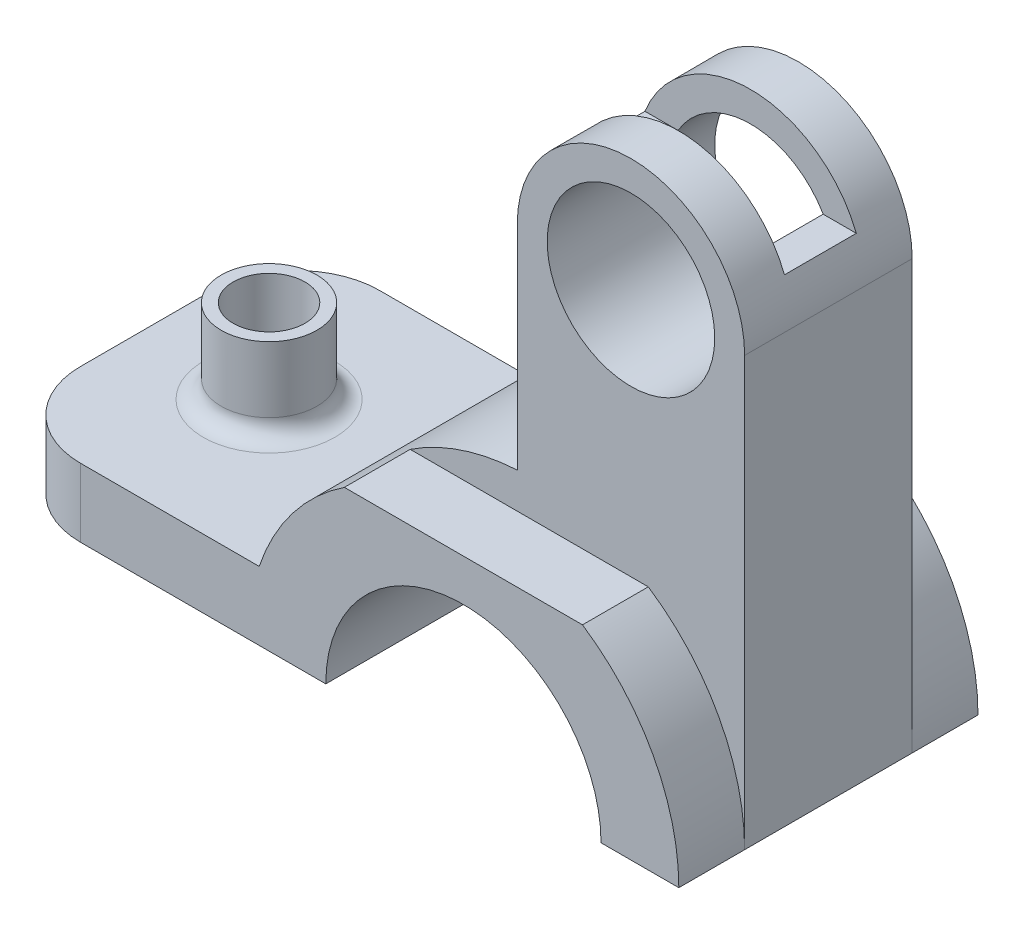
ISO-10303-21;
HEADER;
FILE_DESCRIPTION(('STEP AP214'),'2;1');
FILE_NAME('part.step','',(''),(''),'','','');
FILE_SCHEMA(('AUTOMOTIVE_DESIGN { 1 0 10303 214 1 1 1 1 }'));
ENDSEC;
DATA;
#1=APPLICATION_CONTEXT('core data for automotive mechanical design processes');
#2=APPLICATION_PROTOCOL_DEFINITION('international standard','automotive_design',2000,#1);
#3=PRODUCT_CONTEXT('',#1,'mechanical');
#4=PRODUCT('Part','Part','',(#3));
#5=PRODUCT_RELATED_PRODUCT_CATEGORY('part','',(#4));
#6=PRODUCT_DEFINITION_FORMATION('','',#4);
#7=PRODUCT_DEFINITION_CONTEXT('part definition',#1,'design');
#8=PRODUCT_DEFINITION('design','',#6,#7);
#9=PRODUCT_DEFINITION_SHAPE('','',#8);
#10=(LENGTH_UNIT() NAMED_UNIT(*) SI_UNIT(.MILLI.,.METRE.));
#11=(NAMED_UNIT(*) PLANE_ANGLE_UNIT() SI_UNIT($,.RADIAN.));
#12=(NAMED_UNIT(*) SI_UNIT($,.STERADIAN.) SOLID_ANGLE_UNIT());
#13=UNCERTAINTY_MEASURE_WITH_UNIT(LENGTH_MEASURE(1.E-05),#10,'distance_accuracy_value','');
#14=(GEOMETRIC_REPRESENTATION_CONTEXT(3) GLOBAL_UNCERTAINTY_ASSIGNED_CONTEXT((#13)) GLOBAL_UNIT_ASSIGNED_CONTEXT((#10,
#11,#12)) REPRESENTATION_CONTEXT('',''));
#15=CARTESIAN_POINT('',(0.,0.,0.));
#16=DIRECTION('',(0.,0.,1.));
#17=DIRECTION('',(1.,0.,0.));
#18=AXIS2_PLACEMENT_3D('',#15,#16,#17);
#19=CARTESIAN_POINT('',(0.,0.,25.));
#20=DIRECTION('',(0.,0.,-1.));
#21=DIRECTION('',(-1.,0.,0.));
#22=AXIS2_PLACEMENT_3D('',#19,#20,#21);
#23=CYLINDRICAL_SURFACE('',#22,36.);
#24=CARTESIAN_POINT('',(0.,0.,-25.));
#25=DIRECTION('',(0.,0.,1.));
#26=DIRECTION('',(1.,0.,0.));
#27=AXIS2_PLACEMENT_3D('',#24,#25,#26);
#28=CIRCLE('',#27,36.);
#29=CARTESIAN_POINT('',(36.,0.,-25.));
#30=VERTEX_POINT('',#29);
#31=CARTESIAN_POINT('',(19.8997487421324,30.,-25.));
#32=VERTEX_POINT('',#31);
#33=EDGE_CURVE('E274',#30,#32,#28,.T.);
#34=ORIENTED_EDGE('',*,*,#33,.T.);
#35=DIRECTION('',(0.,0.,-1.));
#36=VECTOR('',#35,1.);
#37=CARTESIAN_POINT('',(19.8997487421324,30.,25.));
#38=LINE('',#37,#36);
#39=CARTESIAN_POINT('',(19.8997487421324,30.,-14.));
#40=VERTEX_POINT('',#39);
#41=EDGE_CURVE('E378',#32,#40,#38,.F.);
#42=ORIENTED_EDGE('',*,*,#41,.T.);
#43=CARTESIAN_POINT('',(0.,0.,-14.));
#44=DIRECTION('',(0.,0.,1.));
#45=DIRECTION('',(1.,0.,0.));
#46=AXIS2_PLACEMENT_3D('',#43,#44,#45);
#47=CIRCLE('',#46,36.);
#48=CARTESIAN_POINT('',(36.,0.,-14.));
#49=VERTEX_POINT('',#48);
#50=EDGE_CURVE('E328',#40,#49,#47,.F.);
#51=ORIENTED_EDGE('',*,*,#50,.T.);
#52=DIRECTION('',(0.,0.,-1.));
#53=VECTOR('',#52,1.);
#54=CARTESIAN_POINT('',(36.,0.,25.));
#55=LINE('',#54,#53);
#56=EDGE_CURVE('E248',#49,#30,#55,.T.);
#57=ORIENTED_EDGE('',*,*,#56,.T.);
#58=EDGE_LOOP('',(#34,#42,#51,#57));
#59=FACE_BOUND('',#58,.T.);
#60=ADVANCED_FACE('F42',(#59),#23,.T.);
#61=CARTESIAN_POINT('',(0.,0.,14.));
#62=DIRECTION('',(0.,0.,1.));
#63=DIRECTION('',(1.,0.,0.));
#64=AXIS2_PLACEMENT_3D('',#61,#62,#63);
#65=CIRCLE('',#64,36.);
#66=CARTESIAN_POINT('',(19.8997487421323,30.,14.));
#67=VERTEX_POINT('',#66);
#68=CARTESIAN_POINT('',(36.,0.,14.));
#69=VERTEX_POINT('',#68);
#70=EDGE_CURVE('E344',#67,#69,#65,.F.);
#71=ORIENTED_EDGE('',*,*,#70,.F.);
#72=DIRECTION('',(0.,0.,-1.));
#73=VECTOR('',#72,1.);
#74=CARTESIAN_POINT('',(19.8997487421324,30.,25.));
#75=LINE('',#74,#73);
#76=CARTESIAN_POINT('',(19.8997487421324,30.,25.));
#77=VERTEX_POINT('',#76);
#78=EDGE_CURVE('E359',#67,#77,#75,.F.);
#79=ORIENTED_EDGE('',*,*,#78,.T.);
#80=CARTESIAN_POINT('',(0.,0.,25.));
#81=DIRECTION('',(0.,0.,1.));
#82=DIRECTION('',(1.,0.,0.));
#83=AXIS2_PLACEMENT_3D('',#80,#81,#82);
#84=CIRCLE('',#83,36.);
#85=CARTESIAN_POINT('',(36.,0.,25.));
#86=VERTEX_POINT('',#85);
#87=EDGE_CURVE('E294',#86,#77,#84,.T.);
#88=ORIENTED_EDGE('',*,*,#87,.F.);
#89=EDGE_CURVE('E244',#86,#69,#55,.T.);
#90=ORIENTED_EDGE('',*,*,#89,.T.);
#91=EDGE_LOOP('',(#71,#79,#88,#90));
#92=FACE_BOUND('',#91,.T.);
#93=ADVANCED_FACE('F433',(#92),#23,.T.);
#94=CARTESIAN_POINT('',(0.,0.,25.));
#95=DIRECTION('',(0.,0.,-1.));
#96=DIRECTION('',(-1.,0.,0.));
#97=AXIS2_PLACEMENT_3D('',#94,#95,#96);
#98=CYLINDRICAL_SURFACE('',#97,23.);
#99=CARTESIAN_POINT('',(0.,0.,-25.));
#100=DIRECTION('',(0.,0.,-1.));
#101=DIRECTION('',(1.,0.,0.));
#102=AXIS2_PLACEMENT_3D('',#99,#100,#101);
#103=CIRCLE('',#102,23.);
#104=CARTESIAN_POINT('',(-23.,0.,-25.));
#105=VERTEX_POINT('',#104);
#106=CARTESIAN_POINT('',(23.,0.,-25.));
#107=VERTEX_POINT('',#106);
#108=EDGE_CURVE('E283',#105,#107,#103,.T.);
#109=ORIENTED_EDGE('',*,*,#108,.T.);
#110=DIRECTION('',(0.,0.,-1.));
#111=VECTOR('',#110,1.);
#112=CARTESIAN_POINT('',(23.,0.,25.));
#113=LINE('',#112,#111);
#114=CARTESIAN_POINT('',(23.,0.,25.));
#115=VERTEX_POINT('',#114);
#116=EDGE_CURVE('E240',#115,#107,#113,.T.);
#117=ORIENTED_EDGE('',*,*,#116,.F.);
#118=CARTESIAN_POINT('',(0.,0.,25.));
#119=DIRECTION('',(0.,0.,-1.));
#120=DIRECTION('',(1.,0.,0.));
#121=AXIS2_PLACEMENT_3D('',#118,#119,#120);
#122=CIRCLE('',#121,23.);
#123=CARTESIAN_POINT('',(-23.,0.,25.));
#124=VERTEX_POINT('',#123);
#125=EDGE_CURVE('E269',#124,#115,#122,.T.);
#126=ORIENTED_EDGE('',*,*,#125,.F.);
#127=DIRECTION('',(0.,0.,-1.));
#128=VECTOR('',#127,1.);
#129=CARTESIAN_POINT('',(-23.,0.,25.));
#130=LINE('',#129,#128);
#131=EDGE_CURVE('E261',#124,#105,#130,.T.);
#132=ORIENTED_EDGE('',*,*,#131,.T.);
#133=EDGE_LOOP('',(#109,#117,#126,#132));
#134=FACE_BOUND('',#133,.T.);
#135=ADVANCED_FACE('F440',(#134),#98,.F.);
#136=CARTESIAN_POINT('',(23.,0.,25.));
#137=DIRECTION('',(0.,1.,0.));
#138=DIRECTION('',(0.,0.,1.));
#139=AXIS2_PLACEMENT_3D('',#136,#137,#138);
#140=PLANE('',#139);
#141=DIRECTION('',(1.,0.,0.));
#142=VECTOR('',#141,1.);
#143=CARTESIAN_POINT('',(23.,0.,-25.));
#144=LINE('',#143,#142);
#145=EDGE_CURVE('E279',#107,#30,#144,.T.);
#146=ORIENTED_EDGE('',*,*,#145,.T.);
#147=ORIENTED_EDGE('',*,*,#56,.F.);
#148=DIRECTION('',(0.,0.,-1.));
#149=VECTOR('',#148,1.);
#150=CARTESIAN_POINT('',(36.,0.,14.));
#151=LINE('',#150,#149);
#152=EDGE_CURVE('E308',#69,#49,#151,.T.);
#153=ORIENTED_EDGE('',*,*,#152,.F.);
#154=ORIENTED_EDGE('',*,*,#89,.F.);
#155=DIRECTION('',(1.,0.,0.));
#156=VECTOR('',#155,1.);
#157=CARTESIAN_POINT('',(23.,0.,25.));
#158=LINE('',#157,#156);
#159=EDGE_CURVE('E299',#115,#86,#158,.T.);
#160=ORIENTED_EDGE('',*,*,#159,.F.);
#161=ORIENTED_EDGE('',*,*,#116,.T.);
#162=EDGE_LOOP('',(#146,#147,#153,#154,#160,#161));
#163=FACE_BOUND('',#162,.T.);
#164=ADVANCED_FACE('F446',(#163),#140,.F.);
#165=CARTESIAN_POINT('',(0.,0.,-14.));
#166=DIRECTION('',(0.,0.,-1.));
#167=DIRECTION('',(-1.,0.,0.));
#168=AXIS2_PLACEMENT_3D('',#165,#166,#167);
#169=CIRCLE('',#168,36.);
#170=CARTESIAN_POINT('',(-19.8997487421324,30.,-14.));
#171=VERTEX_POINT('',#170);
#172=CARTESIAN_POINT('',(-2.,35.9444015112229,-14.));
#173=VERTEX_POINT('',#172);
#174=EDGE_CURVE('E367',#171,#173,#169,.T.);
#175=ORIENTED_EDGE('',*,*,#174,.F.);
#176=DIRECTION('',(0.,0.,-1.));
#177=VECTOR('',#176,1.);
#178=CARTESIAN_POINT('',(-19.8997487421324,30.,25.));
#179=LINE('',#178,#177);
#180=CARTESIAN_POINT('',(-19.8997487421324,30.,-25.));
#181=VERTEX_POINT('',#180);
#182=EDGE_CURVE('E374',#171,#181,#179,.T.);
#183=ORIENTED_EDGE('',*,*,#182,.T.);
#184=CARTESIAN_POINT('',(-34.1335418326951,11.4412115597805,-25.));
#185=VERTEX_POINT('',#184);
#186=EDGE_CURVE('E278',#181,#185,#28,.T.);
#187=ORIENTED_EDGE('',*,*,#186,.T.);
#188=DIRECTION('',(0.,0.,-1.));
#189=VECTOR('',#188,1.);
#190=CARTESIAN_POINT('',(-34.1335418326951,11.4412115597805,25.));
#191=LINE('',#190,#189);
#192=CARTESIAN_POINT('',(-34.1335418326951,11.4412115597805,25.));
#193=VERTEX_POINT('',#192);
#194=EDGE_CURVE('E249',#193,#185,#191,.T.);
#195=ORIENTED_EDGE('',*,*,#194,.F.);
#196=CARTESIAN_POINT('',(-19.8997487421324,30.,25.));
#197=VERTEX_POINT('',#196);
#198=EDGE_CURVE('E298',#197,#193,#84,.T.);
#199=ORIENTED_EDGE('',*,*,#198,.F.);
#200=DIRECTION('',(0.,0.,-1.));
#201=VECTOR('',#200,1.);
#202=CARTESIAN_POINT('',(-19.8997487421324,30.,25.));
#203=LINE('',#202,#201);
#204=CARTESIAN_POINT('',(-19.8997487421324,30.,14.));
#205=VERTEX_POINT('',#204);
#206=EDGE_CURVE('E355',#197,#205,#203,.T.);
#207=ORIENTED_EDGE('',*,*,#206,.T.);
#208=CARTESIAN_POINT('',(0.,0.,14.));
#209=DIRECTION('',(0.,0.,1.));
#210=DIRECTION('',(1.,0.,0.));
#211=AXIS2_PLACEMENT_3D('',#208,#209,#210);
#212=CIRCLE('',#211,36.);
#213=CARTESIAN_POINT('',(-2.,35.9444015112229,14.));
#214=VERTEX_POINT('',#213);
#215=EDGE_CURVE('E338',#214,#205,#212,.T.);
#216=ORIENTED_EDGE('',*,*,#215,.F.);
#217=DIRECTION('',(0.,0.,-1.));
#218=VECTOR('',#217,1.);
#219=CARTESIAN_POINT('',(-2.,35.9444015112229,14.));
#220=LINE('',#219,#218);
#221=EDGE_CURVE('E287',#214,#173,#220,.T.);
#222=ORIENTED_EDGE('',*,*,#221,.T.);
#223=EDGE_LOOP('',(#175,#183,#187,#195,#199,#207,#216,#222));
#224=FACE_BOUND('',#223,.T.);
#225=ADVANCED_FACE('F436',(#224),#23,.T.);
#226=CARTESIAN_POINT('',(-78.,11.4412115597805,25.));
#227=DIRECTION('',(0.,-1.,0.));
#228=DIRECTION('',(1.,0.,0.));
#229=AXIS2_PLACEMENT_3D('',#226,#227,#228);
#230=PLANE('',#229);
#231=CARTESIAN_POINT('',(-57.4853299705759,11.4412115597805,0.));
#232=DIRECTION('',(0.,-1.,0.));
#233=DIRECTION('',(1.,0.,0.));
#234=AXIS2_PLACEMENT_3D('',#231,#232,#233);
#235=CIRCLE('',#234,11.);
#236=CARTESIAN_POINT('',(-46.4853299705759,11.4412115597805,0.));
#237=VERTEX_POINT('',#236);
#238=EDGE_CURVE('E206',#237,#237,#235,.T.);
#239=ORIENTED_EDGE('',*,*,#238,.T.);
#240=EDGE_LOOP('',(#239));
#241=FACE_BOUND('',#240,.T.);
#242=DIRECTION('',(-1.,0.,0.));
#243=VECTOR('',#242,1.);
#244=CARTESIAN_POINT('',(-78.,11.4412115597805,-25.));
#245=LINE('',#244,#243);
#246=CARTESIAN_POINT('',(-64.,11.4412115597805,-25.));
#247=VERTEX_POINT('',#246);
#248=EDGE_CURVE('E270',#185,#247,#245,.T.);
#249=ORIENTED_EDGE('',*,*,#248,.T.);
#250=CARTESIAN_POINT('',(-64.,11.4412115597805,-11.));
#251=DIRECTION('',(0.,-1.,0.));
#252=DIRECTION('',(1.,0.,0.));
#253=AXIS2_PLACEMENT_3D('',#250,#251,#252);
#254=CIRCLE('',#253,14.);
#255=CARTESIAN_POINT('',(-78.,11.4412115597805,-11.));
#256=VERTEX_POINT('',#255);
#257=EDGE_CURVE('E218',#247,#256,#254,.F.);
#258=ORIENTED_EDGE('',*,*,#257,.T.);
#259=DIRECTION('',(0.,0.,-1.));
#260=VECTOR('',#259,1.);
#261=CARTESIAN_POINT('',(-78.,11.4412115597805,25.));
#262=LINE('',#261,#260);
#263=CARTESIAN_POINT('',(-78.,11.4412115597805,11.));
#264=VERTEX_POINT('',#263);
#265=EDGE_CURVE('E253',#264,#256,#262,.T.);
#266=ORIENTED_EDGE('',*,*,#265,.F.);
#267=CARTESIAN_POINT('',(-64.,11.4412115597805,11.));
#268=DIRECTION('',(0.,-1.,0.));
#269=DIRECTION('',(1.,0.,0.));
#270=AXIS2_PLACEMENT_3D('',#267,#268,#269);
#271=CIRCLE('',#270,14.);
#272=CARTESIAN_POINT('',(-64.,11.4412115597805,25.));
#273=VERTEX_POINT('',#272);
#274=EDGE_CURVE('E221',#264,#273,#271,.F.);
#275=ORIENTED_EDGE('',*,*,#274,.T.);
#276=DIRECTION('',(-1.,0.,0.));
#277=VECTOR('',#276,1.);
#278=CARTESIAN_POINT('',(-78.,11.4412115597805,25.));
#279=LINE('',#278,#277);
#280=EDGE_CURVE('E290',#193,#273,#279,.T.);
#281=ORIENTED_EDGE('',*,*,#280,.F.);
#282=ORIENTED_EDGE('',*,*,#194,.T.);
#283=EDGE_LOOP('',(#249,#258,#266,#275,#281,#282));
#284=FACE_BOUND('',#283,.T.);
#285=ADVANCED_FACE('F445',(#241,#284),#230,.F.);
#286=CARTESIAN_POINT('',(-78.,0.,25.));
#287=DIRECTION('',(1.,0.,0.));
#288=DIRECTION('',(0.,0.,-1.));
#289=AXIS2_PLACEMENT_3D('',#286,#287,#288);
#290=PLANE('',#289);
#291=ORIENTED_EDGE('',*,*,#265,.T.);
#292=DIRECTION('',(0.,-1.,0.));
#293=VECTOR('',#292,1.);
#294=CARTESIAN_POINT('',(-78.,0.,-11.));
#295=LINE('',#294,#293);
#296=CARTESIAN_POINT('',(-78.,0.,-11.));
#297=VERTEX_POINT('',#296);
#298=EDGE_CURVE('E233',#256,#297,#295,.T.);
#299=ORIENTED_EDGE('',*,*,#298,.T.);
#300=DIRECTION('',(0.,0.,-1.));
#301=VECTOR('',#300,1.);
#302=CARTESIAN_POINT('',(-78.,0.,25.));
#303=LINE('',#302,#301);
#304=CARTESIAN_POINT('',(-78.,0.,11.));
#305=VERTEX_POINT('',#304);
#306=EDGE_CURVE('E257',#305,#297,#303,.T.);
#307=ORIENTED_EDGE('',*,*,#306,.F.);
#308=DIRECTION('',(0.,-1.,0.));
#309=VECTOR('',#308,1.);
#310=CARTESIAN_POINT('',(-78.,11.4412115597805,11.));
#311=LINE('',#310,#309);
#312=EDGE_CURVE('E237',#305,#264,#311,.F.);
#313=ORIENTED_EDGE('',*,*,#312,.T.);
#314=EDGE_LOOP('',(#291,#299,#307,#313));
#315=FACE_BOUND('',#314,.T.);
#316=ADVANCED_FACE('F452',(#315),#290,.F.);
#317=CARTESIAN_POINT('',(-36.,0.,25.));
#318=DIRECTION('',(0.,1.,0.));
#319=DIRECTION('',(0.,0.,1.));
#320=AXIS2_PLACEMENT_3D('',#317,#318,#319);
#321=PLANE('',#320);
#322=CARTESIAN_POINT('',(-57.4853299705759,0.,0.));
#323=DIRECTION('',(0.,1.,0.));
#324=DIRECTION('',(0.,0.,1.));
#325=AXIS2_PLACEMENT_3D('',#322,#323,#324);
#326=CIRCLE('',#325,5.99999999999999);
#327=CARTESIAN_POINT('',(-57.4853299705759,0.,5.99999999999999));
#328=VERTEX_POINT('',#327);
#329=EDGE_CURVE('E393',#328,#328,#326,.T.);
#330=ORIENTED_EDGE('',*,*,#329,.T.);
#331=EDGE_LOOP('',(#330));
#332=FACE_BOUND('',#331,.T.);
#333=ORIENTED_EDGE('',*,*,#306,.T.);
#334=CARTESIAN_POINT('',(-64.,0.,-11.));
#335=DIRECTION('',(0.,1.,0.));
#336=DIRECTION('',(0.,0.,1.));
#337=AXIS2_PLACEMENT_3D('',#334,#335,#336);
#338=CIRCLE('',#337,14.);
#339=CARTESIAN_POINT('',(-64.,0.,-25.));
#340=VERTEX_POINT('',#339);
#341=EDGE_CURVE('E227',#297,#340,#338,.F.);
#342=ORIENTED_EDGE('',*,*,#341,.T.);
#343=DIRECTION('',(1.,0.,0.));
#344=VECTOR('',#343,1.);
#345=CARTESIAN_POINT('',(-36.,0.,-25.));
#346=LINE('',#345,#344);
#347=EDGE_CURVE('E266',#340,#105,#346,.T.);
#348=ORIENTED_EDGE('',*,*,#347,.T.);
#349=ORIENTED_EDGE('',*,*,#131,.F.);
#350=DIRECTION('',(1.,0.,0.));
#351=VECTOR('',#350,1.);
#352=CARTESIAN_POINT('',(-36.,0.,25.));
#353=LINE('',#352,#351);
#354=CARTESIAN_POINT('',(-64.,0.,25.));
#355=VERTEX_POINT('',#354);
#356=EDGE_CURVE('E265',#355,#124,#353,.T.);
#357=ORIENTED_EDGE('',*,*,#356,.F.);
#358=CARTESIAN_POINT('',(-64.,0.,11.));
#359=DIRECTION('',(0.,1.,0.));
#360=DIRECTION('',(0.,0.,1.));
#361=AXIS2_PLACEMENT_3D('',#358,#359,#360);
#362=CIRCLE('',#361,14.);
#363=EDGE_CURVE('E230',#355,#305,#362,.F.);
#364=ORIENTED_EDGE('',*,*,#363,.T.);
#365=EDGE_LOOP('',(#333,#342,#348,#349,#357,#364));
#366=FACE_BOUND('',#365,.T.);
#367=ADVANCED_FACE('F557',(#332,#366),#321,.F.);
#368=CARTESIAN_POINT('',(0.,0.,25.));
#369=DIRECTION('',(0.,0.,1.));
#370=DIRECTION('',(1.,0.,0.));
#371=AXIS2_PLACEMENT_3D('',#368,#369,#370);
#372=PLANE('',#371);
#373=ORIENTED_EDGE('',*,*,#280,.T.);
#374=DIRECTION('',(0.,-1.,0.));
#375=VECTOR('',#374,1.);
#376=CARTESIAN_POINT('',(-64.,0.,25.));
#377=LINE('',#376,#375);
#378=EDGE_CURVE('E214',#273,#355,#377,.T.);
#379=ORIENTED_EDGE('',*,*,#378,.T.);
#380=ORIENTED_EDGE('',*,*,#356,.T.);
#381=ORIENTED_EDGE('',*,*,#125,.T.);
#382=ORIENTED_EDGE('',*,*,#159,.T.);
#383=ORIENTED_EDGE('',*,*,#87,.T.);
#384=DIRECTION('',(1.,0.,0.));
#385=VECTOR('',#384,1.);
#386=CARTESIAN_POINT('',(-33.9669802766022,30.,25.));
#387=LINE('',#386,#385);
#388=EDGE_CURVE('E364',#197,#77,#387,.T.);
#389=ORIENTED_EDGE('',*,*,#388,.F.);
#390=ORIENTED_EDGE('',*,*,#198,.T.);
#391=EDGE_LOOP('',(#373,#379,#380,#381,#382,#383,#389,#390));
#392=FACE_BOUND('',#391,.T.);
#393=ADVANCED_FACE('F545',(#392),#372,.T.);
#394=CARTESIAN_POINT('',(0.,0.,-25.));
#395=DIRECTION('',(0.,0.,1.));
#396=DIRECTION('',(1.,0.,0.));
#397=AXIS2_PLACEMENT_3D('',#394,#395,#396);
#398=PLANE('',#397);
#399=ORIENTED_EDGE('',*,*,#347,.F.);
#400=DIRECTION('',(0.,-1.,0.));
#401=VECTOR('',#400,1.);
#402=CARTESIAN_POINT('',(-64.,0.,-25.));
#403=LINE('',#402,#401);
#404=EDGE_CURVE('E224',#340,#247,#403,.F.);
#405=ORIENTED_EDGE('',*,*,#404,.T.);
#406=ORIENTED_EDGE('',*,*,#248,.F.);
#407=ORIENTED_EDGE('',*,*,#186,.F.);
#408=DIRECTION('',(-1.,0.,0.));
#409=VECTOR('',#408,1.);
#410=CARTESIAN_POINT('',(49.7403446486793,30.,-25.));
#411=LINE('',#410,#409);
#412=EDGE_CURVE('E383',#32,#181,#411,.T.);
#413=ORIENTED_EDGE('',*,*,#412,.F.);
#414=ORIENTED_EDGE('',*,*,#33,.F.);
#415=ORIENTED_EDGE('',*,*,#145,.F.);
#416=ORIENTED_EDGE('',*,*,#108,.F.);
#417=EDGE_LOOP('',(#399,#405,#406,#407,#413,#414,#415,#416));
#418=FACE_BOUND('',#417,.T.);
#419=ADVANCED_FACE('F473',(#418),#398,.F.);
#420=CARTESIAN_POINT('',(-2.,0.,14.));
#421=DIRECTION('',(1.,0.,0.));
#422=DIRECTION('',(0.,0.,-1.));
#423=AXIS2_PLACEMENT_3D('',#420,#421,#422);
#424=PLANE('',#423);
#425=DIRECTION('',(0.,-1.,0.));
#426=VECTOR('',#425,1.);
#427=CARTESIAN_POINT('',(-2.,0.,-14.));
#428=LINE('',#427,#426);
#429=CARTESIAN_POINT('',(-2.,71.5472988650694,-14.));
#430=VERTEX_POINT('',#429);
#431=EDGE_CURVE('E331',#430,#173,#428,.T.);
#432=ORIENTED_EDGE('',*,*,#431,.T.);
#433=ORIENTED_EDGE('',*,*,#221,.F.);
#434=DIRECTION('',(0.,-1.,0.));
#435=VECTOR('',#434,1.);
#436=CARTESIAN_POINT('',(-2.,0.,14.));
#437=LINE('',#436,#435);
#438=CARTESIAN_POINT('',(-2.,71.5472988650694,14.));
#439=VERTEX_POINT('',#438);
#440=EDGE_CURVE('E347',#439,#214,#437,.T.);
#441=ORIENTED_EDGE('',*,*,#440,.F.);
#442=DIRECTION('',(0.,0.,-1.));
#443=VECTOR('',#442,1.);
#444=CARTESIAN_POINT('',(-2.,71.5472988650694,14.));
#445=LINE('',#444,#443);
#446=EDGE_CURVE('E316',#439,#430,#445,.T.);
#447=ORIENTED_EDGE('',*,*,#446,.T.);
#448=EDGE_LOOP('',(#432,#433,#441,#447));
#449=FACE_BOUND('',#448,.T.);
#450=ADVANCED_FACE('F575',(#449),#424,.F.);
#451=CARTESIAN_POINT('',(36.,0.,14.));
#452=DIRECTION('',(-1.,0.,0.));
#453=DIRECTION('',(0.,0.,1.));
#454=AXIS2_PLACEMENT_3D('',#451,#452,#453);
#455=PLANE('',#454);
#456=DIRECTION('',(0.,1.,0.));
#457=VECTOR('',#456,1.);
#458=CARTESIAN_POINT('',(36.,0.,-14.));
#459=LINE('',#458,#457);
#460=CARTESIAN_POINT('',(36.,71.5472988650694,-14.));
#461=VERTEX_POINT('',#460);
#462=EDGE_CURVE('E325',#49,#461,#459,.T.);
#463=ORIENTED_EDGE('',*,*,#462,.T.);
#464=DIRECTION('',(0.,0.,-1.));
#465=VECTOR('',#464,1.);
#466=CARTESIAN_POINT('',(36.,71.5472988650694,14.));
#467=LINE('',#466,#465);
#468=CARTESIAN_POINT('',(36.,71.5472988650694,14.));
#469=VERTEX_POINT('',#468);
#470=EDGE_CURVE('E312',#469,#461,#467,.T.);
#471=ORIENTED_EDGE('',*,*,#470,.F.);
#472=DIRECTION('',(0.,1.,0.));
#473=VECTOR('',#472,1.);
#474=CARTESIAN_POINT('',(36.,0.,14.));
#475=LINE('',#474,#473);
#476=EDGE_CURVE('E341',#69,#469,#475,.T.);
#477=ORIENTED_EDGE('',*,*,#476,.F.);
#478=ORIENTED_EDGE('',*,*,#152,.T.);
#479=EDGE_LOOP('',(#463,#471,#477,#478));
#480=FACE_BOUND('',#479,.T.);
#481=ADVANCED_FACE('F580',(#480),#455,.F.);
#482=CARTESIAN_POINT('',(17.,71.5472988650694,14.));
#483=DIRECTION('',(0.,0.,-1.));
#484=DIRECTION('',(-1.,0.,0.));
#485=AXIS2_PLACEMENT_3D('',#482,#483,#484);
#486=CYLINDRICAL_SURFACE('',#485,14.);
#487=DIRECTION('',(0.,0.,-1.));
#488=VECTOR('',#487,1.);
#489=CARTESIAN_POINT('',(4.87564434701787,78.5472988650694,14.));
#490=LINE('',#489,#488);
#491=CARTESIAN_POINT('',(4.87564434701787,78.5472988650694,6.));
#492=VERTEX_POINT('',#491);
#493=CARTESIAN_POINT('',(4.87564434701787,78.5472988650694,-6.));
#494=VERTEX_POINT('',#493);
#495=EDGE_CURVE('E406',#492,#494,#490,.T.);
#496=ORIENTED_EDGE('',*,*,#495,.F.);
#497=CARTESIAN_POINT('',(17.,71.5472988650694,6.));
#498=DIRECTION('',(0.,0.,1.));
#499=DIRECTION('',(1.,0.,0.));
#500=AXIS2_PLACEMENT_3D('',#497,#498,#499);
#501=CIRCLE('',#500,14.);
#502=CARTESIAN_POINT('',(29.1243556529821,78.5472988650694,6.));
#503=VERTEX_POINT('',#502);
#504=EDGE_CURVE('E190',#503,#492,#501,.T.);
#505=ORIENTED_EDGE('',*,*,#504,.F.);
#506=DIRECTION('',(0.,0.,-1.));
#507=VECTOR('',#506,1.);
#508=CARTESIAN_POINT('',(29.1243556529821,78.5472988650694,14.));
#509=LINE('',#508,#507);
#510=CARTESIAN_POINT('',(29.1243556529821,78.5472988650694,-6.));
#511=VERTEX_POINT('',#510);
#512=EDGE_CURVE('E409',#511,#503,#509,.F.);
#513=ORIENTED_EDGE('',*,*,#512,.F.);
#514=CARTESIAN_POINT('',(17.,71.5472988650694,-6.));
#515=DIRECTION('',(0.,0.,-1.));
#516=DIRECTION('',(0.,1.,0.));
#517=AXIS2_PLACEMENT_3D('',#514,#515,#516);
#518=CIRCLE('',#517,14.);
#519=EDGE_CURVE('E403',#494,#511,#518,.T.);
#520=ORIENTED_EDGE('',*,*,#519,.F.);
#521=EDGE_LOOP('',(#496,#505,#513,#520));
#522=FACE_BOUND('',#521,.T.);
#523=CARTESIAN_POINT('',(17.,71.5472988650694,14.));
#524=DIRECTION('',(0.,0.,1.));
#525=DIRECTION('',(1.,0.,0.));
#526=AXIS2_PLACEMENT_3D('',#523,#524,#525);
#527=CIRCLE('',#526,14.);
#528=CARTESIAN_POINT('',(31.,71.5472988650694,14.));
#529=VERTEX_POINT('',#528);
#530=EDGE_CURVE('E324',#529,#529,#527,.T.);
#531=ORIENTED_EDGE('',*,*,#530,.T.);
#532=EDGE_LOOP('',(#531));
#533=FACE_BOUND('',#532,.T.);
#534=CARTESIAN_POINT('',(17.,71.5472988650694,-14.));
#535=DIRECTION('',(0.,0.,1.));
#536=DIRECTION('',(1.,0.,0.));
#537=AXIS2_PLACEMENT_3D('',#534,#535,#536);
#538=CIRCLE('',#537,14.);
#539=CARTESIAN_POINT('',(31.,71.5472988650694,-14.));
#540=VERTEX_POINT('',#539);
#541=EDGE_CURVE('E334',#540,#540,#538,.T.);
#542=ORIENTED_EDGE('',*,*,#541,.F.);
#543=EDGE_LOOP('',(#542));
#544=FACE_BOUND('',#543,.T.);
#545=ADVANCED_FACE('F422',(#522,#533,#544),#486,.F.);
#546=CARTESIAN_POINT('',(17.,71.5472988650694,14.));
#547=DIRECTION('',(0.,0.,-1.));
#548=DIRECTION('',(-1.,0.,0.));
#549=AXIS2_PLACEMENT_3D('',#546,#547,#548);
#550=CYLINDRICAL_SURFACE('',#549,19.);
#551=DIRECTION('',(0.,0.,-1.));
#552=VECTOR('',#551,1.);
#553=CARTESIAN_POINT('',(-0.663521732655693,78.5472988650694,14.));
#554=LINE('',#553,#552);
#555=CARTESIAN_POINT('',(-0.663521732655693,78.5472988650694,6.));
#556=VERTEX_POINT('',#555);
#557=CARTESIAN_POINT('',(-0.663521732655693,78.5472988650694,-6.));
#558=VERTEX_POINT('',#557);
#559=EDGE_CURVE('E11',#556,#558,#554,.T.);
#560=ORIENTED_EDGE('',*,*,#559,.T.);
#561=CARTESIAN_POINT('',(17.,71.5472988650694,-6.));
#562=DIRECTION('',(0.,0.,-1.));
#563=DIRECTION('',(0.,1.,0.));
#564=AXIS2_PLACEMENT_3D('',#561,#562,#563);
#565=CIRCLE('',#564,19.);
#566=CARTESIAN_POINT('',(34.6635217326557,78.5472988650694,-6.));
#567=VERTEX_POINT('',#566);
#568=EDGE_CURVE('E199',#558,#567,#565,.T.);
#569=ORIENTED_EDGE('',*,*,#568,.T.);
#570=DIRECTION('',(0.,0.,-1.));
#571=VECTOR('',#570,1.);
#572=CARTESIAN_POINT('',(34.6635217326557,78.5472988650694,14.));
#573=LINE('',#572,#571);
#574=CARTESIAN_POINT('',(34.6635217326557,78.5472988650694,6.));
#575=VERTEX_POINT('',#574);
#576=EDGE_CURVE('E197',#567,#575,#573,.F.);
#577=ORIENTED_EDGE('',*,*,#576,.T.);
#578=CARTESIAN_POINT('',(17.,71.5472988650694,6.));
#579=DIRECTION('',(0.,0.,1.));
#580=DIRECTION('',(1.,0.,0.));
#581=AXIS2_PLACEMENT_3D('',#578,#579,#580);
#582=CIRCLE('',#581,19.);
#583=EDGE_CURVE('E51',#575,#556,#582,.T.);
#584=ORIENTED_EDGE('',*,*,#583,.T.);
#585=EDGE_LOOP('',(#560,#569,#577,#584));
#586=FACE_BOUND('',#585,.T.);
#587=CARTESIAN_POINT('',(17.,71.5472988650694,-14.));
#588=DIRECTION('',(0.,0.,1.));
#589=DIRECTION('',(1.,0.,0.));
#590=AXIS2_PLACEMENT_3D('',#587,#588,#589);
#591=CIRCLE('',#590,19.);
#592=EDGE_CURVE('E321',#461,#430,#591,.T.);
#593=ORIENTED_EDGE('',*,*,#592,.T.);
#594=ORIENTED_EDGE('',*,*,#446,.F.);
#595=CARTESIAN_POINT('',(17.,71.5472988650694,14.));
#596=DIRECTION('',(0.,0.,1.));
#597=DIRECTION('',(1.,0.,0.));
#598=AXIS2_PLACEMENT_3D('',#595,#596,#597);
#599=CIRCLE('',#598,19.);
#600=EDGE_CURVE('E320',#469,#439,#599,.T.);
#601=ORIENTED_EDGE('',*,*,#600,.F.);
#602=ORIENTED_EDGE('',*,*,#470,.T.);
#603=EDGE_LOOP('',(#593,#594,#601,#602));
#604=FACE_BOUND('',#603,.T.);
#605=ADVANCED_FACE('F195',(#586,#604),#550,.T.);
#606=CARTESIAN_POINT('',(0.,0.,14.));
#607=DIRECTION('',(0.,0.,1.));
#608=DIRECTION('',(1.,0.,0.));
#609=AXIS2_PLACEMENT_3D('',#606,#607,#608);
#610=PLANE('',#609);
#611=ORIENTED_EDGE('',*,*,#476,.T.);
#612=ORIENTED_EDGE('',*,*,#600,.T.);
#613=ORIENTED_EDGE('',*,*,#440,.T.);
#614=ORIENTED_EDGE('',*,*,#215,.T.);
#615=DIRECTION('',(1.,0.,0.));
#616=VECTOR('',#615,1.);
#617=CARTESIAN_POINT('',(-33.9669802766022,30.,14.));
#618=LINE('',#617,#616);
#619=EDGE_CURVE('E363',#205,#67,#618,.T.);
#620=ORIENTED_EDGE('',*,*,#619,.T.);
#621=ORIENTED_EDGE('',*,*,#70,.T.);
#622=EDGE_LOOP('',(#611,#612,#613,#614,#620,#621));
#623=FACE_BOUND('',#622,.T.);
#624=ORIENTED_EDGE('',*,*,#530,.F.);
#625=EDGE_LOOP('',(#624));
#626=FACE_BOUND('',#625,.T.);
#627=ADVANCED_FACE('F571',(#623,#626),#610,.T.);
#628=CARTESIAN_POINT('',(0.,0.,-14.));
#629=DIRECTION('',(0.,0.,1.));
#630=DIRECTION('',(1.,0.,0.));
#631=AXIS2_PLACEMENT_3D('',#628,#629,#630);
#632=PLANE('',#631);
#633=ORIENTED_EDGE('',*,*,#50,.F.);
#634=DIRECTION('',(-1.,0.,0.));
#635=VECTOR('',#634,1.);
#636=CARTESIAN_POINT('',(49.7403446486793,30.,-14.));
#637=LINE('',#636,#635);
#638=EDGE_CURVE('E382',#40,#171,#637,.T.);
#639=ORIENTED_EDGE('',*,*,#638,.T.);
#640=ORIENTED_EDGE('',*,*,#174,.T.);
#641=ORIENTED_EDGE('',*,*,#431,.F.);
#642=ORIENTED_EDGE('',*,*,#592,.F.);
#643=ORIENTED_EDGE('',*,*,#462,.F.);
#644=EDGE_LOOP('',(#633,#639,#640,#641,#642,#643));
#645=FACE_BOUND('',#644,.T.);
#646=ORIENTED_EDGE('',*,*,#541,.T.);
#647=EDGE_LOOP('',(#646));
#648=FACE_BOUND('',#647,.T.);
#649=ADVANCED_FACE('F462',(#645,#648),#632,.F.);
#650=CARTESIAN_POINT('',(-33.9669802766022,30.,14.));
#651=DIRECTION('',(0.,-1.,0.));
#652=DIRECTION('',(0.,0.,-1.));
#653=AXIS2_PLACEMENT_3D('',#650,#651,#652);
#654=PLANE('',#653);
#655=ORIENTED_EDGE('',*,*,#388,.T.);
#656=ORIENTED_EDGE('',*,*,#78,.F.);
#657=ORIENTED_EDGE('',*,*,#619,.F.);
#658=ORIENTED_EDGE('',*,*,#206,.F.);
#659=EDGE_LOOP('',(#655,#656,#657,#658));
#660=FACE_BOUND('',#659,.T.);
#661=ADVANCED_FACE('F569',(#660),#654,.F.);
#662=CARTESIAN_POINT('',(49.7403446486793,30.,-14.));
#663=DIRECTION('',(0.,-1.,0.));
#664=DIRECTION('',(0.,0.,-1.));
#665=AXIS2_PLACEMENT_3D('',#662,#663,#664);
#666=PLANE('',#665);
#667=ORIENTED_EDGE('',*,*,#638,.F.);
#668=ORIENTED_EDGE('',*,*,#41,.F.);
#669=ORIENTED_EDGE('',*,*,#412,.T.);
#670=ORIENTED_EDGE('',*,*,#182,.F.);
#671=EDGE_LOOP('',(#667,#668,#669,#670));
#672=FACE_BOUND('',#671,.T.);
#673=ADVANCED_FACE('F467',(#672),#666,.F.);
#674=CARTESIAN_POINT('',(-57.4853299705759,25.4412115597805,0.));
#675=DIRECTION('',(0.,-1.,0.));
#676=DIRECTION('',(1.,0.,0.));
#677=AXIS2_PLACEMENT_3D('',#674,#675,#676);
#678=CYLINDRICAL_SURFACE('',#677,8.);
#679=CARTESIAN_POINT('',(-57.4853299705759,14.4412115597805,0.));
#680=DIRECTION('',(0.,-1.,0.));
#681=DIRECTION('',(1.,0.,0.));
#682=AXIS2_PLACEMENT_3D('',#679,#680,#681);
#683=CIRCLE('',#682,8.);
#684=CARTESIAN_POINT('',(-49.4853299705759,14.4412115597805,0.));
#685=VERTEX_POINT('',#684);
#686=EDGE_CURVE('E210',#685,#685,#683,.F.);
#687=ORIENTED_EDGE('',*,*,#686,.T.);
#688=EDGE_LOOP('',(#687));
#689=FACE_BOUND('',#688,.T.);
#690=CARTESIAN_POINT('',(-57.4853299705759,25.4412115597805,0.));
#691=DIRECTION('',(0.,1.,0.));
#692=DIRECTION('',(-1.,0.,0.));
#693=AXIS2_PLACEMENT_3D('',#690,#691,#692);
#694=CIRCLE('',#693,8.);
#695=CARTESIAN_POINT('',(-65.4853299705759,25.4412115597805,0.));
#696=VERTEX_POINT('',#695);
#697=EDGE_CURVE('E386',#696,#696,#694,.T.);
#698=ORIENTED_EDGE('',*,*,#697,.F.);
#699=EDGE_LOOP('',(#698));
#700=FACE_BOUND('',#699,.T.);
#701=ADVANCED_FACE('F723',(#689,#700),#678,.T.);
#702=CARTESIAN_POINT('',(-57.4853299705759,25.4412115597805,0.));
#703=DIRECTION('',(0.,1.,0.));
#704=DIRECTION('',(-1.,0.,0.));
#705=AXIS2_PLACEMENT_3D('',#702,#703,#704);
#706=PLANE('',#705);
#707=CARTESIAN_POINT('',(-57.4853299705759,25.4412115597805,0.));
#708=DIRECTION('',(0.,1.,0.));
#709=DIRECTION('',(-1.,0.,0.));
#710=AXIS2_PLACEMENT_3D('',#707,#708,#709);
#711=CIRCLE('',#710,5.99999999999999);
#712=CARTESIAN_POINT('',(-63.4853299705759,25.4412115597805,0.));
#713=VERTEX_POINT('',#712);
#714=EDGE_CURVE('E397',#713,#713,#711,.T.);
#715=ORIENTED_EDGE('',*,*,#714,.F.);
#716=EDGE_LOOP('',(#715));
#717=FACE_BOUND('',#716,.T.);
#718=ORIENTED_EDGE('',*,*,#697,.T.);
#719=EDGE_LOOP('',(#718));
#720=FACE_BOUND('',#719,.T.);
#721=ADVANCED_FACE('F615',(#717,#720),#706,.T.);
#722=CARTESIAN_POINT('',(-57.4853299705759,-4.5587884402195,0.));
#723=DIRECTION('',(0.,1.,0.));
#724=DIRECTION('',(-1.,0.,0.));
#725=AXIS2_PLACEMENT_3D('',#722,#723,#724);
#726=CYLINDRICAL_SURFACE('',#725,5.99999999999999);
#727=ORIENTED_EDGE('',*,*,#714,.T.);
#728=EDGE_LOOP('',(#727));
#729=FACE_BOUND('',#728,.T.);
#730=ORIENTED_EDGE('',*,*,#329,.F.);
#731=EDGE_LOOP('',(#730));
#732=FACE_BOUND('',#731,.T.);
#733=ADVANCED_FACE('F609',(#729,#732),#726,.F.);
#734=CARTESIAN_POINT('',(-64.,0.,-11.));
#735=DIRECTION('',(0.,-1.,0.));
#736=DIRECTION('',(0.,0.,-1.));
#737=AXIS2_PLACEMENT_3D('',#734,#735,#736);
#738=CYLINDRICAL_SURFACE('',#737,14.);
#739=ORIENTED_EDGE('',*,*,#257,.F.);
#740=ORIENTED_EDGE('',*,*,#404,.F.);
#741=ORIENTED_EDGE('',*,*,#341,.F.);
#742=ORIENTED_EDGE('',*,*,#298,.F.);
#743=EDGE_LOOP('',(#739,#740,#741,#742));
#744=FACE_BOUND('',#743,.T.);
#745=ADVANCED_FACE('F606',(#744),#738,.T.);
#746=CARTESIAN_POINT('',(-64.,0.,11.));
#747=DIRECTION('',(0.,1.,0.));
#748=DIRECTION('',(0.,0.,1.));
#749=AXIS2_PLACEMENT_3D('',#746,#747,#748);
#750=CYLINDRICAL_SURFACE('',#749,14.);
#751=ORIENTED_EDGE('',*,*,#274,.F.);
#752=ORIENTED_EDGE('',*,*,#312,.F.);
#753=ORIENTED_EDGE('',*,*,#363,.F.);
#754=ORIENTED_EDGE('',*,*,#378,.F.);
#755=EDGE_LOOP('',(#751,#752,#753,#754));
#756=FACE_BOUND('',#755,.T.);
#757=ADVANCED_FACE('F553',(#756),#750,.T.);
#758=CARTESIAN_POINT('',(-57.4853299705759,14.4412115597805,0.));
#759=DIRECTION('',(0.,-1.,0.));
#760=DIRECTION('',(1.,0.,0.));
#761=AXIS2_PLACEMENT_3D('',#758,#759,#760);
#762=TOROIDAL_SURFACE('',#761,11.,3.);
#763=ORIENTED_EDGE('',*,*,#238,.F.);
#764=EDGE_LOOP('',(#763));
#765=FACE_BOUND('',#764,.T.);
#766=ORIENTED_EDGE('',*,*,#686,.F.);
#767=EDGE_LOOP('',(#766));
#768=FACE_BOUND('',#767,.T.);
#769=ADVANCED_FACE('F44',(#765,#768),#762,.F.);
#770=CARTESIAN_POINT('',(-5.00000000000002,90.5472988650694,6.));
#771=DIRECTION('',(0.,0.,1.));
#772=DIRECTION('',(1.,0.,0.));
#773=AXIS2_PLACEMENT_3D('',#770,#771,#772);
#774=PLANE('',#773);
#775=ORIENTED_EDGE('',*,*,#504,.T.);
#776=DIRECTION('',(1.,0.,0.));
#777=VECTOR('',#776,1.);
#778=CARTESIAN_POINT('',(-5.00000000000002,78.5472988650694,6.));
#779=LINE('',#778,#777);
#780=EDGE_CURVE('E182',#556,#492,#779,.T.);
#781=ORIENTED_EDGE('',*,*,#780,.F.);
#782=ORIENTED_EDGE('',*,*,#583,.F.);
#783=EDGE_CURVE('E192',#503,#575,#779,.T.);
#784=ORIENTED_EDGE('',*,*,#783,.F.);
#785=EDGE_LOOP('',(#775,#781,#782,#784));
#786=FACE_BOUND('',#785,.T.);
#787=ADVANCED_FACE('F188',(#786),#774,.F.);
#788=CARTESIAN_POINT('',(-5.00000000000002,90.5472988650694,-6.));
#789=DIRECTION('',(0.,0.,-1.));
#790=DIRECTION('',(0.,1.,0.));
#791=AXIS2_PLACEMENT_3D('',#788,#789,#790);
#792=PLANE('',#791);
#793=ORIENTED_EDGE('',*,*,#519,.T.);
#794=DIRECTION('',(1.,0.,0.));
#795=VECTOR('',#794,1.);
#796=CARTESIAN_POINT('',(-5.00000000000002,78.5472988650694,-6.));
#797=LINE('',#796,#795);
#798=EDGE_CURVE('E58',#511,#567,#797,.T.);
#799=ORIENTED_EDGE('',*,*,#798,.T.);
#800=ORIENTED_EDGE('',*,*,#568,.F.);
#801=EDGE_CURVE('E185',#558,#494,#797,.T.);
#802=ORIENTED_EDGE('',*,*,#801,.T.);
#803=EDGE_LOOP('',(#793,#799,#800,#802));
#804=FACE_BOUND('',#803,.T.);
#805=ADVANCED_FACE('F419',(#804),#792,.F.);
#806=CARTESIAN_POINT('',(-5.00000000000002,78.5472988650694,6.));
#807=DIRECTION('',(0.,-1.,0.));
#808=DIRECTION('',(0.,0.,-1.));
#809=AXIS2_PLACEMENT_3D('',#806,#807,#808);
#810=PLANE('',#809);
#811=ORIENTED_EDGE('',*,*,#495,.T.);
#812=ORIENTED_EDGE('',*,*,#801,.F.);
#813=ORIENTED_EDGE('',*,*,#559,.F.);
#814=ORIENTED_EDGE('',*,*,#780,.T.);
#815=EDGE_LOOP('',(#811,#812,#813,#814));
#816=FACE_BOUND('',#815,.T.);
#817=ADVANCED_FACE('F181',(#816),#810,.F.);
#818=ORIENTED_EDGE('',*,*,#512,.T.);
#819=ORIENTED_EDGE('',*,*,#783,.T.);
#820=ORIENTED_EDGE('',*,*,#576,.F.);
#821=ORIENTED_EDGE('',*,*,#798,.F.);
#822=EDGE_LOOP('',(#818,#819,#820,#821));
#823=FACE_BOUND('',#822,.T.);
#824=ADVANCED_FACE('F424',(#823),#810,.F.);
#825=CLOSED_SHELL('',(#60,#93,#135,#164,#225,#285,#316,#367,#393,#419,#450,#481,#545,#605,#627,
#649,#661,#673,#701,#721,#733,#745,#757,#769,#787,#805,#817,#824));
#826=MANIFOLD_SOLID_BREP('B2',#825);
#827=ADVANCED_BREP_SHAPE_REPRESENTATION('',(#18,#826),#14);
#828=SHAPE_DEFINITION_REPRESENTATION(#9,#827);
ENDSEC;
END-ISO-10303-21;
